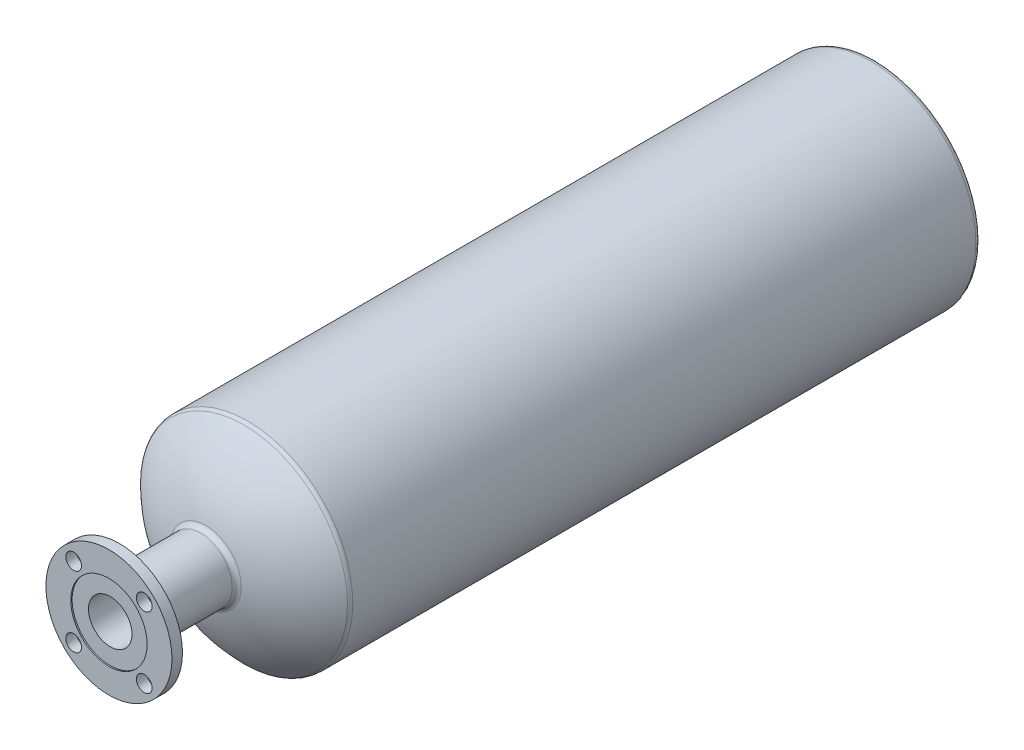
from build123d import *

# Parameters (mm, degrees)
SKETCH8_R          = 76.2
SKETCH8_R_2        = 9.525
SKETCH8_R_3        = 46.101
FLANGE_DEPTH       = 12.7
SKETCH8_3_R        = 9.525
MTG_HOLES_DEPTH    = 109.508847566
BOLT_PATTERN_COUNT = 4
SKETCH10_R         = 38.1
TAILPIECE_DEPTH    = 152.4
FILLET1_R          = 6.35
SKETCH16_R         = 26.289
CUT_EXTRUDE1_DEPTH = 127
SKETCH17_R         = 46.101
CUT_EXTRUDE2_DEPTH = 1.5875


with BuildPart() as part:
    # Sketch8 → Flange (new body)
    # profile 1 of 3: a face of its own
    with BuildSketch(Plane.XY):
        Circle(SKETCH8_R)
        with Locations((42.656216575, 42.656216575)):
            Circle(SKETCH8_R_2, mode=Mode.SUBTRACT)
        Circle(SKETCH8_R_3, mode=Mode.SUBTRACT)
    # profile 2 of 3: a face of its own
    with BuildSketch(Plane.XY):
        Circle(SKETCH8_R_3)
    # profile 3 of 3: a face of its own
    with BuildSketch(Plane.XY):
        with Locations((42.656216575, 42.656216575)):
            Circle(SKETCH8_R_2)
    extrude(amount=FLANGE_DEPTH)

    # Sketch8_3 → Mtg_Holes (cut, through all)
    with BuildSketch(Plane.XY):
        with Locations((42.656216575, 42.656216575)):
            Circle(SKETCH8_3_R)
    mtg_holes = extrude(amount=MTG_HOLES_DEPTH, mode=Mode.SUBTRACT)

    # Bolt_Pattern: Mtg_Holes ×4 about axis
    bolt_pattern_axis = Axis((0, 0, 0), (0, 0, 1))
    for i in range(1, BOLT_PATTERN_COUNT):
        add(mtg_holes.rotate(bolt_pattern_axis, i * 360 / BOLT_PATTERN_COUNT), mode=Mode.SUBTRACT)

    # Sketch10 → Tailpiece (add)
    with BuildSketch(Plane(origin=(0, 0, 0), x_dir=(-1, 0, 0), z_dir=(0, 0, -1))):
        with Locations(Location((0, 0, 0), (0, 0, 180))):
            Circle(SKETCH10_R)
    extrude(amount=TAILPIECE_DEPTH)

    # Sketch15 → Revolve1 (revolve)
    with BuildSketch(Plane(origin=(0, 0, 0), x_dir=(0, 0, -1), z_dir=(1, 0, 0)), mode=Mode.PRIVATE) as revolve1_sk:
        with BuildLine():
            Line((99.034078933, 0), (914.4, 0))
            Line((914.4, 0), (914.4, 127))
            Line((914.4, 127), (152.4, 127))
            ThreePointArc((152.4, 127), (112.917607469, 68.87837384), (99.034078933, 0))
        make_face()
    revolve(revolve1_sk.sketch.rotate(Axis((0, 0, -152.4), (0, 0, -1)), 90), axis=Axis((0, 0, -152.4), (0, 0, -1)))

    # Fillet1
    fillet1_edges = [part.edges().sort_by_distance(p)[0] for p in [
        (-38.1, 0, 0),
        (-38.099999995, 0, -103.164190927),
        (-127, 0, -152.4),
        (-127, 0, -914.4),
    ]]
    fillet(fillet1_edges, radius=FILLET1_R)

    # Sketch16 → Cut-Extrude1 (cut)
    with BuildSketch(Plane.XY.offset(12.7)):
        Circle(SKETCH16_R)
    extrude(amount=-CUT_EXTRUDE1_DEPTH, mode=Mode.SUBTRACT)

    # Sketch17 → Cut-Extrude2 (cut)
    with BuildSketch(Plane.XY.offset(12.7)):
        Circle(SKETCH17_R)
    extrude(amount=-CUT_EXTRUDE2_DEPTH, mode=Mode.SUBTRACT)


solid = part.part
